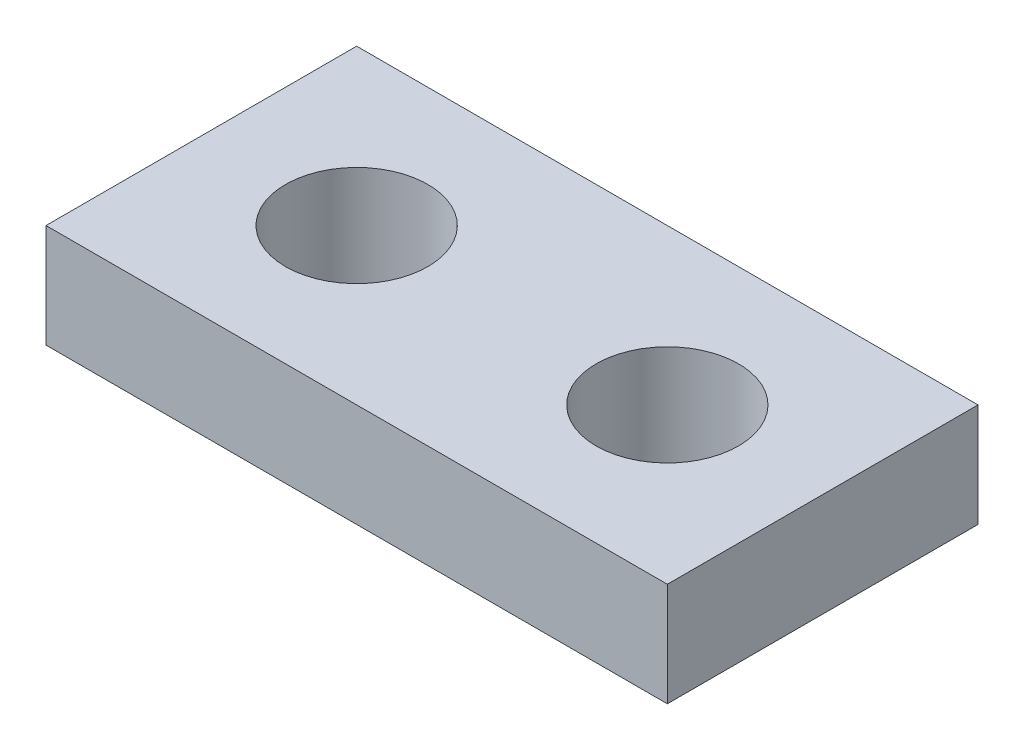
from build123d import *

# Parameters (mm, degrees)
SKETCH1_W               = 76.2
SKETCH1_H               = 38.1
BOSS_EXTRUDE1_DEPTH     = 12.7
SKETCH2_R               = 8.73125
CUT_EXTRUDE1_DEPTH      = 45.45
F_3_4_16_TAPPED_HOLE1_D = 17.4625


with BuildPart() as part:
    # Sketch1 → Boss-Extrude1 (new body)
    with BuildSketch(Plane(origin=(0, 0, 0), x_dir=(1, 0, 0), z_dir=(0, 1, 0))):
        Rectangle(SKETCH1_W, SKETCH1_H)
    extrude(amount=-BOSS_EXTRUDE1_DEPTH)

    # Sketch2 → Cut-Extrude1 (cut, through all)
    with BuildSketch(Plane(origin=(0, 0, 0), x_dir=(1, 0, 0), z_dir=(0, 1, 0))):
        with Locations(Location((-19.05, 0, 0), (0, 0, 270))):
            Circle(SKETCH2_R)
    extrude(amount=-CUT_EXTRUDE1_DEPTH, mode=Mode.SUBTRACT)

    # 3_4-16 Tapped Hole1 (through all)
    with Locations(Plane(origin=(0, 0, 0), x_dir=(1, 0, 0), z_dir=(0, 1, 0))):
        with Locations((19.05, 0)):
            Hole(F_3_4_16_TAPPED_HOLE1_D / 2)


solid = part.part
